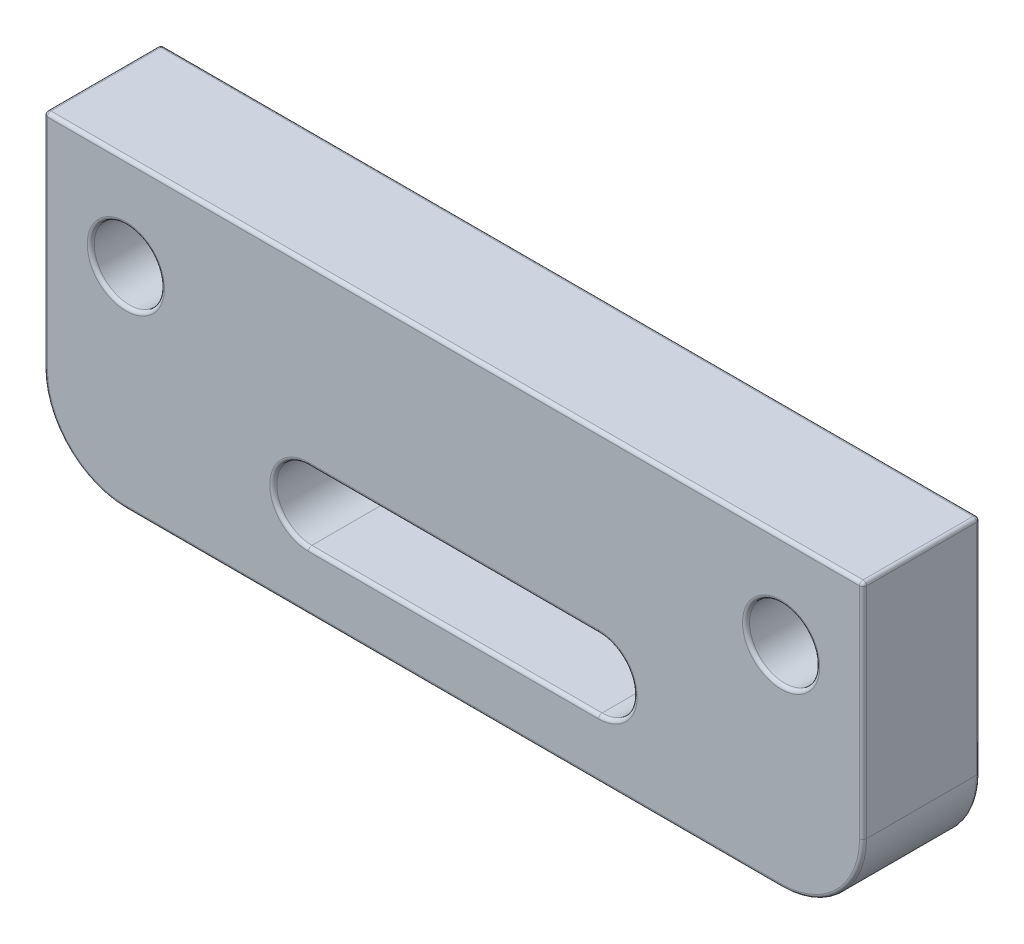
ISO-10303-21;
HEADER;
FILE_DESCRIPTION(('STEP AP214'),'2;1');
FILE_NAME('part.step','',(''),(''),'','','');
FILE_SCHEMA(('AUTOMOTIVE_DESIGN { 1 0 10303 214 1 1 1 1 }'));
ENDSEC;
DATA;
#1=APPLICATION_CONTEXT('core data for automotive mechanical design processes');
#2=APPLICATION_PROTOCOL_DEFINITION('international standard','automotive_design',2000,#1);
#3=PRODUCT_CONTEXT('',#1,'mechanical');
#4=PRODUCT('Part','Part','',(#3));
#5=PRODUCT_RELATED_PRODUCT_CATEGORY('part','',(#4));
#6=PRODUCT_DEFINITION_FORMATION('','',#4);
#7=PRODUCT_DEFINITION_CONTEXT('part definition',#1,'design');
#8=PRODUCT_DEFINITION('design','',#6,#7);
#9=PRODUCT_DEFINITION_SHAPE('','',#8);
#10=(LENGTH_UNIT() NAMED_UNIT(*) SI_UNIT(.MILLI.,.METRE.));
#11=(NAMED_UNIT(*) PLANE_ANGLE_UNIT() SI_UNIT($,.RADIAN.));
#12=(NAMED_UNIT(*) SI_UNIT($,.STERADIAN.) SOLID_ANGLE_UNIT());
#13=UNCERTAINTY_MEASURE_WITH_UNIT(LENGTH_MEASURE(1.E-05),#10,'distance_accuracy_value','');
#14=(GEOMETRIC_REPRESENTATION_CONTEXT(3) GLOBAL_UNCERTAINTY_ASSIGNED_CONTEXT((#13)) GLOBAL_UNIT_ASSIGNED_CONTEXT((#10,
#11,#12)) REPRESENTATION_CONTEXT('',''));
#15=CARTESIAN_POINT('',(0.,0.,0.));
#16=DIRECTION('',(0.,0.,1.));
#17=DIRECTION('',(1.,0.,0.));
#18=AXIS2_PLACEMENT_3D('',#15,#16,#17);
#19=CARTESIAN_POINT('',(0.,8.49264705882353,5.));
#20=DIRECTION('',(0.,0.,-1.));
#21=DIRECTION('',(-1.,0.,0.));
#22=AXIS2_PLACEMENT_3D('',#19,#20,#21);
#23=PLANE('',#22);
#24=CARTESIAN_POINT('',(14.,-15.5,5.));
#25=DIRECTION('',(0.,0.,-1.));
#26=DIRECTION('',(-1.,0.,0.));
#27=AXIS2_PLACEMENT_3D('',#24,#25,#26);
#28=CIRCLE('',#27,3.35);
#29=CARTESIAN_POINT('',(14.,-18.85,5.));
#30=VERTEX_POINT('',#29);
#31=CARTESIAN_POINT('',(17.35,-15.5,5.));
#32=VERTEX_POINT('',#31);
#33=EDGE_CURVE('E42',#30,#32,#28,.F.);
#34=ORIENTED_EDGE('',*,*,#33,.T.);
#35=DIRECTION('',(0.,1.,0.));
#36=VECTOR('',#35,1.);
#37=CARTESIAN_POINT('',(17.35,8.49264705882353,5.));
#38=LINE('',#37,#36);
#39=CARTESIAN_POINT('',(17.35,-6.15,5.));
#40=VERTEX_POINT('',#39);
#41=EDGE_CURVE('E11',#32,#40,#38,.T.);
#42=ORIENTED_EDGE('',*,*,#41,.T.);
#43=DIRECTION('',(1.,0.,0.));
#44=VECTOR('',#43,1.);
#45=CARTESIAN_POINT('',(-17.5,-6.15,5.));
#46=LINE('',#45,#44);
#47=CARTESIAN_POINT('',(-17.35,-6.15,5.));
#48=VERTEX_POINT('',#47);
#49=EDGE_CURVE('E324',#40,#48,#46,.F.);
#50=ORIENTED_EDGE('',*,*,#49,.T.);
#51=DIRECTION('',(0.,-1.,0.));
#52=VECTOR('',#51,1.);
#53=CARTESIAN_POINT('',(-17.35,8.49264705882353,5.));
#54=LINE('',#53,#52);
#55=CARTESIAN_POINT('',(-17.35,-15.5,5.));
#56=VERTEX_POINT('',#55);
#57=EDGE_CURVE('E326',#48,#56,#54,.T.);
#58=ORIENTED_EDGE('',*,*,#57,.T.);
#59=CARTESIAN_POINT('',(-14.,-15.5,5.));
#60=DIRECTION('',(0.,0.,-1.));
#61=DIRECTION('',(-1.,0.,0.));
#62=AXIS2_PLACEMENT_3D('',#59,#60,#61);
#63=CIRCLE('',#62,3.35);
#64=CARTESIAN_POINT('',(-14.,-18.85,5.));
#65=VERTEX_POINT('',#64);
#66=EDGE_CURVE('E328',#56,#65,#63,.F.);
#67=ORIENTED_EDGE('',*,*,#66,.T.);
#68=DIRECTION('',(1.,0.,0.));
#69=VECTOR('',#68,1.);
#70=CARTESIAN_POINT('',(0.,-18.85,5.));
#71=LINE('',#70,#69);
#72=EDGE_CURVE('E53',#65,#30,#71,.T.);
#73=ORIENTED_EDGE('',*,*,#72,.T.);
#74=EDGE_LOOP('',(#34,#42,#50,#58,#67,#73));
#75=FACE_BOUND('',#74,.T.);
#76=CARTESIAN_POINT('',(-14.,-10.,5.));
#77=DIRECTION('',(0.,0.,-1.));
#78=DIRECTION('',(-1.,0.,0.));
#79=AXIS2_PLACEMENT_3D('',#76,#77,#78);
#80=CIRCLE('',#79,1.65);
#81=CARTESIAN_POINT('',(-15.65,-10.,5.));
#82=VERTEX_POINT('',#81);
#83=EDGE_CURVE('E321',#82,#82,#80,.T.);
#84=ORIENTED_EDGE('',*,*,#83,.T.);
#85=EDGE_LOOP('',(#84));
#86=FACE_BOUND('',#85,.T.);
#87=CARTESIAN_POINT('',(6.2,-15.,5.));
#88=DIRECTION('',(0.,0.,-1.));
#89=DIRECTION('',(-1.,0.,0.));
#90=AXIS2_PLACEMENT_3D('',#87,#88,#89);
#91=CIRCLE('',#90,1.65);
#92=CARTESIAN_POINT('',(6.2,-13.35,5.));
#93=VERTEX_POINT('',#92);
#94=CARTESIAN_POINT('',(6.2,-16.65,5.));
#95=VERTEX_POINT('',#94);
#96=EDGE_CURVE('E316',#93,#95,#91,.T.);
#97=ORIENTED_EDGE('',*,*,#96,.T.);
#98=DIRECTION('',(1.,0.,0.));
#99=VECTOR('',#98,1.);
#100=CARTESIAN_POINT('',(-6.2,-16.65,5.));
#101=LINE('',#100,#99);
#102=CARTESIAN_POINT('',(-6.2,-16.65,5.));
#103=VERTEX_POINT('',#102);
#104=EDGE_CURVE('E318',#95,#103,#101,.F.);
#105=ORIENTED_EDGE('',*,*,#104,.T.);
#106=CARTESIAN_POINT('',(-6.2,-15.,5.));
#107=DIRECTION('',(0.,0.,-1.));
#108=DIRECTION('',(-1.,0.,0.));
#109=AXIS2_PLACEMENT_3D('',#106,#107,#108);
#110=CIRCLE('',#109,1.65);
#111=CARTESIAN_POINT('',(-6.2,-13.35,5.));
#112=VERTEX_POINT('',#111);
#113=EDGE_CURVE('E312',#103,#112,#110,.T.);
#114=ORIENTED_EDGE('',*,*,#113,.T.);
#115=DIRECTION('',(-1.,0.,0.));
#116=VECTOR('',#115,1.);
#117=CARTESIAN_POINT('',(6.2,-13.35,5.));
#118=LINE('',#117,#116);
#119=EDGE_CURVE('E314',#112,#93,#118,.F.);
#120=ORIENTED_EDGE('',*,*,#119,.T.);
#121=EDGE_LOOP('',(#97,#105,#114,#120));
#122=FACE_BOUND('',#121,.T.);
#123=CARTESIAN_POINT('',(14.,-10.,5.));
#124=DIRECTION('',(0.,0.,-1.));
#125=DIRECTION('',(-1.,0.,0.));
#126=AXIS2_PLACEMENT_3D('',#123,#124,#125);
#127=CIRCLE('',#126,1.65);
#128=CARTESIAN_POINT('',(12.35,-10.,5.));
#129=VERTEX_POINT('',#128);
#130=EDGE_CURVE('E309',#129,#129,#127,.T.);
#131=ORIENTED_EDGE('',*,*,#130,.T.);
#132=EDGE_LOOP('',(#131));
#133=FACE_BOUND('',#132,.T.);
#134=ADVANCED_FACE('F33',(#75,#86,#122,#133),#23,.F.);
#135=CARTESIAN_POINT('',(0.,8.49264705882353,0.));
#136=DIRECTION('',(0.,0.,-1.));
#137=DIRECTION('',(-1.,0.,0.));
#138=AXIS2_PLACEMENT_3D('',#135,#136,#137);
#139=PLANE('',#138);
#140=DIRECTION('',(1.,0.,0.));
#141=VECTOR('',#140,1.);
#142=CARTESIAN_POINT('',(-14.,-18.85,0.));
#143=LINE('',#142,#141);
#144=CARTESIAN_POINT('',(14.,-18.85,0.));
#145=VERTEX_POINT('',#144);
#146=CARTESIAN_POINT('',(-14.,-18.85,0.));
#147=VERTEX_POINT('',#146);
#148=EDGE_CURVE('E262',#145,#147,#143,.F.);
#149=ORIENTED_EDGE('',*,*,#148,.T.);
#150=CARTESIAN_POINT('',(-14.,-15.5,0.));
#151=DIRECTION('',(0.,0.,-1.));
#152=DIRECTION('',(-1.,0.,0.));
#153=AXIS2_PLACEMENT_3D('',#150,#151,#152);
#154=CIRCLE('',#153,3.35);
#155=CARTESIAN_POINT('',(-17.35,-15.5,0.));
#156=VERTEX_POINT('',#155);
#157=EDGE_CURVE('E264',#147,#156,#154,.T.);
#158=ORIENTED_EDGE('',*,*,#157,.T.);
#159=DIRECTION('',(0.,-1.,0.));
#160=VECTOR('',#159,1.);
#161=CARTESIAN_POINT('',(-17.35,-6.,0.));
#162=LINE('',#161,#160);
#163=CARTESIAN_POINT('',(-17.35,-6.15,0.));
#164=VERTEX_POINT('',#163);
#165=EDGE_CURVE('E254',#156,#164,#162,.F.);
#166=ORIENTED_EDGE('',*,*,#165,.T.);
#167=DIRECTION('',(1.,0.,0.));
#168=VECTOR('',#167,1.);
#169=CARTESIAN_POINT('',(0.,-6.15,0.));
#170=LINE('',#169,#168);
#171=CARTESIAN_POINT('',(17.35,-6.15,0.));
#172=VERTEX_POINT('',#171);
#173=EDGE_CURVE('E256',#164,#172,#170,.T.);
#174=ORIENTED_EDGE('',*,*,#173,.T.);
#175=DIRECTION('',(0.,1.,0.));
#176=VECTOR('',#175,1.);
#177=CARTESIAN_POINT('',(17.35,-15.5,0.));
#178=LINE('',#177,#176);
#179=CARTESIAN_POINT('',(17.35,-15.5,0.));
#180=VERTEX_POINT('',#179);
#181=EDGE_CURVE('E258',#172,#180,#178,.F.);
#182=ORIENTED_EDGE('',*,*,#181,.T.);
#183=CARTESIAN_POINT('',(14.,-15.5,0.));
#184=DIRECTION('',(0.,0.,-1.));
#185=DIRECTION('',(-1.,0.,0.));
#186=AXIS2_PLACEMENT_3D('',#183,#184,#185);
#187=CIRCLE('',#186,3.35);
#188=EDGE_CURVE('E260',#180,#145,#187,.T.);
#189=ORIENTED_EDGE('',*,*,#188,.T.);
#190=EDGE_LOOP('',(#149,#158,#166,#174,#182,#189));
#191=FACE_BOUND('',#190,.T.);
#192=CARTESIAN_POINT('',(-14.,-10.,0.));
#193=DIRECTION('',(0.,0.,-1.));
#194=DIRECTION('',(-1.,0.,0.));
#195=AXIS2_PLACEMENT_3D('',#192,#193,#194);
#196=CIRCLE('',#195,1.65);
#197=CARTESIAN_POINT('',(-15.65,-10.,0.));
#198=VERTEX_POINT('',#197);
#199=EDGE_CURVE('E251',#198,#198,#196,.F.);
#200=ORIENTED_EDGE('',*,*,#199,.T.);
#201=EDGE_LOOP('',(#200));
#202=FACE_BOUND('',#201,.T.);
#203=DIRECTION('',(1.,0.,0.));
#204=VECTOR('',#203,1.);
#205=CARTESIAN_POINT('',(0.,-16.65,0.));
#206=LINE('',#205,#204);
#207=CARTESIAN_POINT('',(-6.2,-16.65,0.));
#208=VERTEX_POINT('',#207);
#209=CARTESIAN_POINT('',(6.2,-16.65,0.));
#210=VERTEX_POINT('',#209);
#211=EDGE_CURVE('E246',#208,#210,#206,.T.);
#212=ORIENTED_EDGE('',*,*,#211,.T.);
#213=CARTESIAN_POINT('',(6.2,-15.,0.));
#214=DIRECTION('',(0.,0.,-1.));
#215=DIRECTION('',(-1.,0.,0.));
#216=AXIS2_PLACEMENT_3D('',#213,#214,#215);
#217=CIRCLE('',#216,1.65);
#218=CARTESIAN_POINT('',(6.2,-13.35,0.));
#219=VERTEX_POINT('',#218);
#220=EDGE_CURVE('E248',#210,#219,#217,.F.);
#221=ORIENTED_EDGE('',*,*,#220,.T.);
#222=DIRECTION('',(-1.,0.,0.));
#223=VECTOR('',#222,1.);
#224=CARTESIAN_POINT('',(0.,-13.35,0.));
#225=LINE('',#224,#223);
#226=CARTESIAN_POINT('',(-6.2,-13.35,0.));
#227=VERTEX_POINT('',#226);
#228=EDGE_CURVE('E242',#219,#227,#225,.T.);
#229=ORIENTED_EDGE('',*,*,#228,.T.);
#230=CARTESIAN_POINT('',(-6.2,-15.,0.));
#231=DIRECTION('',(0.,0.,-1.));
#232=DIRECTION('',(-1.,0.,0.));
#233=AXIS2_PLACEMENT_3D('',#230,#231,#232);
#234=CIRCLE('',#233,1.65);
#235=EDGE_CURVE('E244',#227,#208,#234,.F.);
#236=ORIENTED_EDGE('',*,*,#235,.T.);
#237=EDGE_LOOP('',(#212,#221,#229,#236));
#238=FACE_BOUND('',#237,.T.);
#239=CARTESIAN_POINT('',(14.,-10.,0.));
#240=DIRECTION('',(0.,0.,-1.));
#241=DIRECTION('',(-1.,0.,0.));
#242=AXIS2_PLACEMENT_3D('',#239,#240,#241);
#243=CIRCLE('',#242,1.65);
#244=CARTESIAN_POINT('',(12.35,-10.,0.));
#245=VERTEX_POINT('',#244);
#246=EDGE_CURVE('E239',#245,#245,#243,.F.);
#247=ORIENTED_EDGE('',*,*,#246,.T.);
#248=EDGE_LOOP('',(#247));
#249=FACE_BOUND('',#248,.T.);
#250=ADVANCED_FACE('F489',(#191,#202,#238,#249),#139,.T.);
#251=CARTESIAN_POINT('',(-17.5,9.,5.));
#252=DIRECTION('',(1.,0.,0.));
#253=DIRECTION('',(0.,0.,-1.));
#254=AXIS2_PLACEMENT_3D('',#251,#252,#253);
#255=PLANE('',#254);
#256=DIRECTION('',(0.,0.,1.));
#257=VECTOR('',#256,1.);
#258=CARTESIAN_POINT('',(-17.5,-6.15,0.));
#259=LINE('',#258,#257);
#260=CARTESIAN_POINT('',(-17.5,-6.15,4.85));
#261=VERTEX_POINT('',#260);
#262=CARTESIAN_POINT('',(-17.5,-6.15,0.15));
#263=VERTEX_POINT('',#262);
#264=EDGE_CURVE('E200',#261,#263,#259,.F.);
#265=ORIENTED_EDGE('',*,*,#264,.T.);
#266=DIRECTION('',(0.,-1.,0.));
#267=VECTOR('',#266,1.);
#268=CARTESIAN_POINT('',(-17.5,-15.5,0.15));
#269=LINE('',#268,#267);
#270=CARTESIAN_POINT('',(-17.5,-15.5,0.15));
#271=VERTEX_POINT('',#270);
#272=EDGE_CURVE('E237',#263,#271,#269,.T.);
#273=ORIENTED_EDGE('',*,*,#272,.T.);
#274=DIRECTION('',(0.,0.,-1.));
#275=VECTOR('',#274,1.);
#276=CARTESIAN_POINT('',(-17.5,-15.5,5.));
#277=LINE('',#276,#275);
#278=CARTESIAN_POINT('',(-17.5,-15.5,4.85));
#279=VERTEX_POINT('',#278);
#280=EDGE_CURVE('E218',#271,#279,#277,.F.);
#281=ORIENTED_EDGE('',*,*,#280,.T.);
#282=DIRECTION('',(0.,-1.,0.));
#283=VECTOR('',#282,1.);
#284=CARTESIAN_POINT('',(-17.5,9.,4.85));
#285=LINE('',#284,#283);
#286=EDGE_CURVE('E234',#279,#261,#285,.F.);
#287=ORIENTED_EDGE('',*,*,#286,.T.);
#288=EDGE_LOOP('',(#265,#273,#281,#287));
#289=FACE_BOUND('',#288,.T.);
#290=ADVANCED_FACE('F474',(#289),#255,.F.);
#291=CARTESIAN_POINT('',(17.5,9.,5.));
#292=DIRECTION('',(-1.,0.,0.));
#293=DIRECTION('',(0.,0.,1.));
#294=AXIS2_PLACEMENT_3D('',#291,#292,#293);
#295=PLANE('',#294);
#296=DIRECTION('',(0.,0.,-1.));
#297=VECTOR('',#296,1.);
#298=CARTESIAN_POINT('',(17.5,-15.5,5.));
#299=LINE('',#298,#297);
#300=CARTESIAN_POINT('',(17.5,-15.5,4.85));
#301=VERTEX_POINT('',#300);
#302=CARTESIAN_POINT('',(17.5,-15.5,0.15));
#303=VERTEX_POINT('',#302);
#304=EDGE_CURVE('E430',#301,#303,#299,.T.);
#305=ORIENTED_EDGE('',*,*,#304,.T.);
#306=DIRECTION('',(0.,1.,0.));
#307=VECTOR('',#306,1.);
#308=CARTESIAN_POINT('',(17.5,-6.,0.15));
#309=LINE('',#308,#307);
#310=CARTESIAN_POINT('',(17.5,-6.15,0.15));
#311=VERTEX_POINT('',#310);
#312=EDGE_CURVE('E232',#303,#311,#309,.T.);
#313=ORIENTED_EDGE('',*,*,#312,.T.);
#314=DIRECTION('',(0.,0.,-1.));
#315=VECTOR('',#314,1.);
#316=CARTESIAN_POINT('',(17.5,-6.15,5.));
#317=LINE('',#316,#315);
#318=CARTESIAN_POINT('',(17.5,-6.15,4.85));
#319=VERTEX_POINT('',#318);
#320=EDGE_CURVE('E229',#311,#319,#317,.F.);
#321=ORIENTED_EDGE('',*,*,#320,.T.);
#322=DIRECTION('',(0.,1.,0.));
#323=VECTOR('',#322,1.);
#324=CARTESIAN_POINT('',(17.5,9.,4.85));
#325=LINE('',#324,#323);
#326=EDGE_CURVE('E227',#319,#301,#325,.F.);
#327=ORIENTED_EDGE('',*,*,#326,.T.);
#328=EDGE_LOOP('',(#305,#313,#321,#327));
#329=FACE_BOUND('',#328,.T.);
#330=ADVANCED_FACE('F525',(#329),#295,.F.);
#331=CARTESIAN_POINT('',(-17.5,-19.,5.));
#332=DIRECTION('',(0.,1.,0.));
#333=DIRECTION('',(0.,0.,1.));
#334=AXIS2_PLACEMENT_3D('',#331,#332,#333);
#335=PLANE('',#334);
#336=DIRECTION('',(0.,0.,-1.));
#337=VECTOR('',#336,1.);
#338=CARTESIAN_POINT('',(-14.,-19.,5.));
#339=LINE('',#338,#337);
#340=CARTESIAN_POINT('',(-14.,-19.,4.85));
#341=VERTEX_POINT('',#340);
#342=CARTESIAN_POINT('',(-14.,-19.,0.15));
#343=VERTEX_POINT('',#342);
#344=EDGE_CURVE('E437',#341,#343,#339,.T.);
#345=ORIENTED_EDGE('',*,*,#344,.T.);
#346=DIRECTION('',(1.,0.,0.));
#347=VECTOR('',#346,1.);
#348=CARTESIAN_POINT('',(14.,-19.,0.15));
#349=LINE('',#348,#347);
#350=CARTESIAN_POINT('',(14.,-19.,0.15));
#351=VERTEX_POINT('',#350);
#352=EDGE_CURVE('E273',#343,#351,#349,.T.);
#353=ORIENTED_EDGE('',*,*,#352,.T.);
#354=DIRECTION('',(0.,0.,-1.));
#355=VECTOR('',#354,1.);
#356=CARTESIAN_POINT('',(14.,-19.,5.));
#357=LINE('',#356,#355);
#358=CARTESIAN_POINT('',(14.,-19.,4.85));
#359=VERTEX_POINT('',#358);
#360=EDGE_CURVE('E221',#351,#359,#357,.F.);
#361=ORIENTED_EDGE('',*,*,#360,.T.);
#362=DIRECTION('',(1.,0.,0.));
#363=VECTOR('',#362,1.);
#364=CARTESIAN_POINT('',(-17.5,-19.,4.85));
#365=LINE('',#364,#363);
#366=EDGE_CURVE('E271',#359,#341,#365,.F.);
#367=ORIENTED_EDGE('',*,*,#366,.T.);
#368=EDGE_LOOP('',(#345,#353,#361,#367));
#369=FACE_BOUND('',#368,.T.);
#370=ADVANCED_FACE('F443',(#369),#335,.F.);
#371=CARTESIAN_POINT('',(11.5,-6.,5.));
#372=DIRECTION('',(0.,1.,0.));
#373=DIRECTION('',(-1.,0.,0.));
#374=AXIS2_PLACEMENT_3D('',#371,#372,#373);
#375=PLANE('',#374);
#376=DIRECTION('',(0.,0.,-1.));
#377=VECTOR('',#376,1.);
#378=CARTESIAN_POINT('',(17.35,-6.,0.));
#379=LINE('',#378,#377);
#380=CARTESIAN_POINT('',(17.35,-6.,4.85));
#381=VERTEX_POINT('',#380);
#382=CARTESIAN_POINT('',(17.35,-6.,0.15));
#383=VERTEX_POINT('',#382);
#384=EDGE_CURVE('E193',#381,#383,#379,.T.);
#385=ORIENTED_EDGE('',*,*,#384,.T.);
#386=DIRECTION('',(1.,0.,0.));
#387=VECTOR('',#386,1.);
#388=CARTESIAN_POINT('',(11.5,-6.,0.15));
#389=LINE('',#388,#387);
#390=CARTESIAN_POINT('',(-17.35,-6.,0.15));
#391=VERTEX_POINT('',#390);
#392=EDGE_CURVE('E189',#383,#391,#389,.F.);
#393=ORIENTED_EDGE('',*,*,#392,.T.);
#394=DIRECTION('',(0.,0.,1.));
#395=VECTOR('',#394,1.);
#396=CARTESIAN_POINT('',(-17.35,-6.,5.));
#397=LINE('',#396,#395);
#398=CARTESIAN_POINT('',(-17.35,-6.,4.85));
#399=VERTEX_POINT('',#398);
#400=EDGE_CURVE('E181',#391,#399,#397,.T.);
#401=ORIENTED_EDGE('',*,*,#400,.T.);
#402=DIRECTION('',(1.,0.,0.));
#403=VECTOR('',#402,1.);
#404=CARTESIAN_POINT('',(17.5,-6.,4.85));
#405=LINE('',#404,#403);
#406=EDGE_CURVE('E186',#399,#381,#405,.T.);
#407=ORIENTED_EDGE('',*,*,#406,.T.);
#408=EDGE_LOOP('',(#385,#393,#401,#407));
#409=FACE_BOUND('',#408,.T.);
#410=ADVANCED_FACE('F184',(#409),#375,.T.);
#411=CARTESIAN_POINT('',(-14.,-10.,5.));
#412=DIRECTION('',(0.,0.,-1.));
#413=DIRECTION('',(-1.,0.,0.));
#414=AXIS2_PLACEMENT_3D('',#411,#412,#413);
#415=CYLINDRICAL_SURFACE('',#414,1.5);
#416=CARTESIAN_POINT('',(-14.,-10.,0.15));
#417=DIRECTION('',(0.,0.,-1.));
#418=DIRECTION('',(-1.,0.,0.));
#419=AXIS2_PLACEMENT_3D('',#416,#417,#418);
#420=CIRCLE('',#419,1.5);
#421=CARTESIAN_POINT('',(-15.5,-10.,0.15));
#422=VERTEX_POINT('',#421);
#423=EDGE_CURVE('E282',#422,#422,#420,.T.);
#424=ORIENTED_EDGE('',*,*,#423,.T.);
#425=EDGE_LOOP('',(#424));
#426=FACE_BOUND('',#425,.T.);
#427=CARTESIAN_POINT('',(-14.,-10.,4.85));
#428=DIRECTION('',(0.,0.,-1.));
#429=DIRECTION('',(-1.,0.,0.));
#430=AXIS2_PLACEMENT_3D('',#427,#428,#429);
#431=CIRCLE('',#430,1.5);
#432=CARTESIAN_POINT('',(-15.5,-10.,4.85));
#433=VERTEX_POINT('',#432);
#434=EDGE_CURVE('E279',#433,#433,#431,.F.);
#435=ORIENTED_EDGE('',*,*,#434,.T.);
#436=EDGE_LOOP('',(#435));
#437=FACE_BOUND('',#436,.T.);
#438=ADVANCED_FACE('F796',(#426,#437),#415,.F.);
#439=CARTESIAN_POINT('',(-6.2,-15.,5.));
#440=DIRECTION('',(0.,0.,-1.));
#441=DIRECTION('',(-1.,0.,0.));
#442=AXIS2_PLACEMENT_3D('',#439,#440,#441);
#443=CYLINDRICAL_SURFACE('',#442,1.5);
#444=DIRECTION('',(0.,0.,-1.));
#445=VECTOR('',#444,1.);
#446=CARTESIAN_POINT('',(-6.2,-16.5,5.));
#447=LINE('',#446,#445);
#448=CARTESIAN_POINT('',(-6.2,-16.5,4.85));
#449=VERTEX_POINT('',#448);
#450=CARTESIAN_POINT('',(-6.2,-16.5,0.15));
#451=VERTEX_POINT('',#450);
#452=EDGE_CURVE('E425',#449,#451,#447,.T.);
#453=ORIENTED_EDGE('',*,*,#452,.T.);
#454=CARTESIAN_POINT('',(-6.2,-15.,0.15));
#455=DIRECTION('',(0.,0.,-1.));
#456=DIRECTION('',(-1.,0.,0.));
#457=AXIS2_PLACEMENT_3D('',#454,#455,#456);
#458=CIRCLE('',#457,1.5);
#459=CARTESIAN_POINT('',(-6.2,-13.5,0.15));
#460=VERTEX_POINT('',#459);
#461=EDGE_CURVE('E297',#451,#460,#458,.T.);
#462=ORIENTED_EDGE('',*,*,#461,.T.);
#463=DIRECTION('',(0.,0.,-1.));
#464=VECTOR('',#463,1.);
#465=CARTESIAN_POINT('',(-6.2,-13.5,5.));
#466=LINE('',#465,#464);
#467=CARTESIAN_POINT('',(-6.2,-13.5,4.85));
#468=VERTEX_POINT('',#467);
#469=EDGE_CURVE('E377',#468,#460,#466,.T.);
#470=ORIENTED_EDGE('',*,*,#469,.F.);
#471=CARTESIAN_POINT('',(-6.2,-15.,4.85));
#472=DIRECTION('',(0.,0.,-1.));
#473=DIRECTION('',(-1.,0.,0.));
#474=AXIS2_PLACEMENT_3D('',#471,#472,#473);
#475=CIRCLE('',#474,1.5);
#476=EDGE_CURVE('E295',#468,#449,#475,.F.);
#477=ORIENTED_EDGE('',*,*,#476,.T.);
#478=EDGE_LOOP('',(#453,#462,#470,#477));
#479=FACE_BOUND('',#478,.T.);
#480=ADVANCED_FACE('F861',(#479),#443,.F.);
#481=CARTESIAN_POINT('',(-6.2,-16.5,5.));
#482=DIRECTION('',(0.,1.,0.));
#483=DIRECTION('',(0.,0.,1.));
#484=AXIS2_PLACEMENT_3D('',#481,#482,#483);
#485=PLANE('',#484);
#486=DIRECTION('',(0.,0.,-1.));
#487=VECTOR('',#486,1.);
#488=CARTESIAN_POINT('',(6.2,-16.5,5.));
#489=LINE('',#488,#487);
#490=CARTESIAN_POINT('',(6.2,-16.5,4.85));
#491=VERTEX_POINT('',#490);
#492=CARTESIAN_POINT('',(6.2,-16.5,0.15));
#493=VERTEX_POINT('',#492);
#494=EDGE_CURVE('E423',#491,#493,#489,.T.);
#495=ORIENTED_EDGE('',*,*,#494,.T.);
#496=DIRECTION('',(1.,0.,0.));
#497=VECTOR('',#496,1.);
#498=CARTESIAN_POINT('',(-6.2,-16.5,0.15));
#499=LINE('',#498,#497);
#500=EDGE_CURVE('E293',#493,#451,#499,.F.);
#501=ORIENTED_EDGE('',*,*,#500,.T.);
#502=ORIENTED_EDGE('',*,*,#452,.F.);
#503=DIRECTION('',(1.,0.,0.));
#504=VECTOR('',#503,1.);
#505=CARTESIAN_POINT('',(6.2,-16.5,4.85));
#506=LINE('',#505,#504);
#507=EDGE_CURVE('E290',#449,#491,#506,.T.);
#508=ORIENTED_EDGE('',*,*,#507,.T.);
#509=EDGE_LOOP('',(#495,#501,#502,#508));
#510=FACE_BOUND('',#509,.T.);
#511=ADVANCED_FACE('F422',(#510),#485,.T.);
#512=CARTESIAN_POINT('',(6.2,-15.,5.));
#513=DIRECTION('',(0.,0.,-1.));
#514=DIRECTION('',(-1.,0.,0.));
#515=AXIS2_PLACEMENT_3D('',#512,#513,#514);
#516=CYLINDRICAL_SURFACE('',#515,1.5);
#517=DIRECTION('',(0.,0.,-1.));
#518=VECTOR('',#517,1.);
#519=CARTESIAN_POINT('',(6.2,-13.5,5.));
#520=LINE('',#519,#518);
#521=CARTESIAN_POINT('',(6.2,-13.5,4.85));
#522=VERTEX_POINT('',#521);
#523=CARTESIAN_POINT('',(6.2,-13.5,0.15));
#524=VERTEX_POINT('',#523);
#525=EDGE_CURVE('E428',#522,#524,#520,.T.);
#526=ORIENTED_EDGE('',*,*,#525,.T.);
#527=CARTESIAN_POINT('',(6.2,-15.,0.15));
#528=DIRECTION('',(0.,0.,-1.));
#529=DIRECTION('',(-1.,0.,0.));
#530=AXIS2_PLACEMENT_3D('',#527,#528,#529);
#531=CIRCLE('',#530,1.5);
#532=EDGE_CURVE('E287',#524,#493,#531,.T.);
#533=ORIENTED_EDGE('',*,*,#532,.T.);
#534=ORIENTED_EDGE('',*,*,#494,.F.);
#535=CARTESIAN_POINT('',(6.2,-15.,4.85));
#536=DIRECTION('',(0.,0.,-1.));
#537=DIRECTION('',(-1.,0.,0.));
#538=AXIS2_PLACEMENT_3D('',#535,#536,#537);
#539=CIRCLE('',#538,1.5);
#540=EDGE_CURVE('E285',#491,#522,#539,.F.);
#541=ORIENTED_EDGE('',*,*,#540,.T.);
#542=EDGE_LOOP('',(#526,#533,#534,#541));
#543=FACE_BOUND('',#542,.T.);
#544=ADVANCED_FACE('F426',(#543),#516,.F.);
#545=CARTESIAN_POINT('',(-6.2,-13.5,5.));
#546=DIRECTION('',(0.,-1.,0.));
#547=DIRECTION('',(0.,0.,-1.));
#548=AXIS2_PLACEMENT_3D('',#545,#546,#547);
#549=PLANE('',#548);
#550=ORIENTED_EDGE('',*,*,#469,.T.);
#551=DIRECTION('',(-1.,0.,0.));
#552=VECTOR('',#551,1.);
#553=CARTESIAN_POINT('',(-6.2,-13.5,0.15));
#554=LINE('',#553,#552);
#555=EDGE_CURVE('E301',#460,#524,#554,.F.);
#556=ORIENTED_EDGE('',*,*,#555,.T.);
#557=ORIENTED_EDGE('',*,*,#525,.F.);
#558=DIRECTION('',(-1.,0.,0.));
#559=VECTOR('',#558,1.);
#560=CARTESIAN_POINT('',(-6.2,-13.5,4.85));
#561=LINE('',#560,#559);
#562=EDGE_CURVE('E299',#522,#468,#561,.T.);
#563=ORIENTED_EDGE('',*,*,#562,.T.);
#564=EDGE_LOOP('',(#550,#556,#557,#563));
#565=FACE_BOUND('',#564,.T.);
#566=ADVANCED_FACE('F837',(#565),#549,.T.);
#567=CARTESIAN_POINT('',(14.,-10.,5.));
#568=DIRECTION('',(0.,0.,-1.));
#569=DIRECTION('',(-1.,0.,0.));
#570=AXIS2_PLACEMENT_3D('',#567,#568,#569);
#571=CYLINDRICAL_SURFACE('',#570,1.5);
#572=CARTESIAN_POINT('',(14.,-10.,0.15));
#573=DIRECTION('',(0.,0.,-1.));
#574=DIRECTION('',(-1.,0.,0.));
#575=AXIS2_PLACEMENT_3D('',#572,#573,#574);
#576=CIRCLE('',#575,1.5);
#577=CARTESIAN_POINT('',(12.5,-10.,0.15));
#578=VERTEX_POINT('',#577);
#579=EDGE_CURVE('E306',#578,#578,#576,.T.);
#580=ORIENTED_EDGE('',*,*,#579,.T.);
#581=EDGE_LOOP('',(#580));
#582=FACE_BOUND('',#581,.T.);
#583=CARTESIAN_POINT('',(14.,-10.,4.85));
#584=DIRECTION('',(0.,0.,-1.));
#585=DIRECTION('',(-1.,0.,0.));
#586=AXIS2_PLACEMENT_3D('',#583,#584,#585);
#587=CIRCLE('',#586,1.5);
#588=CARTESIAN_POINT('',(12.5,-10.,4.85));
#589=VERTEX_POINT('',#588);
#590=EDGE_CURVE('E303',#589,#589,#587,.F.);
#591=ORIENTED_EDGE('',*,*,#590,.T.);
#592=EDGE_LOOP('',(#591));
#593=FACE_BOUND('',#592,.T.);
#594=ADVANCED_FACE('F536',(#582,#593),#571,.F.);
#595=CARTESIAN_POINT('',(14.,-15.5,5.));
#596=DIRECTION('',(0.,0.,-1.));
#597=DIRECTION('',(-1.,0.,0.));
#598=AXIS2_PLACEMENT_3D('',#595,#596,#597);
#599=CYLINDRICAL_SURFACE('',#598,3.5);
#600=ORIENTED_EDGE('',*,*,#360,.F.);
#601=CARTESIAN_POINT('',(14.,-15.5,0.15));
#602=DIRECTION('',(0.,0.,-1.));
#603=DIRECTION('',(-1.,0.,0.));
#604=AXIS2_PLACEMENT_3D('',#601,#602,#603);
#605=CIRCLE('',#604,3.5);
#606=EDGE_CURVE('E277',#351,#303,#605,.F.);
#607=ORIENTED_EDGE('',*,*,#606,.T.);
#608=ORIENTED_EDGE('',*,*,#304,.F.);
#609=CARTESIAN_POINT('',(14.,-15.5,4.85));
#610=DIRECTION('',(0.,0.,-1.));
#611=DIRECTION('',(-1.,0.,0.));
#612=AXIS2_PLACEMENT_3D('',#609,#610,#611);
#613=CIRCLE('',#612,3.5);
#614=EDGE_CURVE('E275',#301,#359,#613,.T.);
#615=ORIENTED_EDGE('',*,*,#614,.T.);
#616=EDGE_LOOP('',(#600,#607,#608,#615));
#617=FACE_BOUND('',#616,.T.);
#618=ADVANCED_FACE('F533',(#617),#599,.T.);
#619=CARTESIAN_POINT('',(-14.,-15.5,5.));
#620=DIRECTION('',(0.,0.,-1.));
#621=DIRECTION('',(-1.,0.,0.));
#622=AXIS2_PLACEMENT_3D('',#619,#620,#621);
#623=CYLINDRICAL_SURFACE('',#622,3.5);
#624=ORIENTED_EDGE('',*,*,#280,.F.);
#625=CARTESIAN_POINT('',(-14.,-15.5,0.15));
#626=DIRECTION('',(0.,0.,-1.));
#627=DIRECTION('',(-1.,0.,0.));
#628=AXIS2_PLACEMENT_3D('',#625,#626,#627);
#629=CIRCLE('',#628,3.5);
#630=EDGE_CURVE('E269',#271,#343,#629,.F.);
#631=ORIENTED_EDGE('',*,*,#630,.T.);
#632=ORIENTED_EDGE('',*,*,#344,.F.);
#633=CARTESIAN_POINT('',(-14.,-15.5,4.85));
#634=DIRECTION('',(0.,0.,-1.));
#635=DIRECTION('',(-1.,0.,0.));
#636=AXIS2_PLACEMENT_3D('',#633,#634,#635);
#637=CIRCLE('',#636,3.5);
#638=EDGE_CURVE('E267',#341,#279,#637,.T.);
#639=ORIENTED_EDGE('',*,*,#638,.T.);
#640=EDGE_LOOP('',(#624,#631,#632,#639));
#641=FACE_BOUND('',#640,.T.);
#642=ADVANCED_FACE('F471',(#641),#623,.T.);
#643=CARTESIAN_POINT('',(-14.,-15.5,4.85));
#644=DIRECTION('',(0.,0.,-1.));
#645=DIRECTION('',(-1.,0.,0.));
#646=AXIS2_PLACEMENT_3D('',#643,#644,#645);
#647=TOROIDAL_SURFACE('',#646,3.35,0.15);
#648=CARTESIAN_POINT('',(-17.35,-15.5,4.85));
#649=DIRECTION('',(0.,1.,0.));
#650=DIRECTION('',(0.,0.,1.));
#651=AXIS2_PLACEMENT_3D('',#648,#649,#650);
#652=CIRCLE('',#651,0.15);
#653=EDGE_CURVE('E371',#279,#56,#652,.T.);
#654=ORIENTED_EDGE('',*,*,#653,.F.);
#655=ORIENTED_EDGE('',*,*,#638,.F.);
#656=CARTESIAN_POINT('',(-14.,-18.85,4.85));
#657=DIRECTION('',(1.,0.,0.));
#658=DIRECTION('',(0.,0.,-1.));
#659=AXIS2_PLACEMENT_3D('',#656,#657,#658);
#660=CIRCLE('',#659,0.15);
#661=EDGE_CURVE('E374',#65,#341,#660,.T.);
#662=ORIENTED_EDGE('',*,*,#661,.F.);
#663=ORIENTED_EDGE('',*,*,#66,.F.);
#664=EDGE_LOOP('',(#654,#655,#662,#663));
#665=FACE_BOUND('',#664,.T.);
#666=ADVANCED_FACE('F468',(#665),#647,.T.);
#667=CARTESIAN_POINT('',(-14.,-15.5,0.15));
#668=DIRECTION('',(0.,0.,-1.));
#669=DIRECTION('',(-1.,0.,0.));
#670=AXIS2_PLACEMENT_3D('',#667,#668,#669);
#671=TOROIDAL_SURFACE('',#670,3.35,0.15);
#672=CARTESIAN_POINT('',(-14.,-18.85,0.15));
#673=DIRECTION('',(1.,0.,0.));
#674=DIRECTION('',(0.,0.,-1.));
#675=AXIS2_PLACEMENT_3D('',#672,#673,#674);
#676=CIRCLE('',#675,0.15);
#677=EDGE_CURVE('E365',#343,#147,#676,.T.);
#678=ORIENTED_EDGE('',*,*,#677,.F.);
#679=ORIENTED_EDGE('',*,*,#630,.F.);
#680=CARTESIAN_POINT('',(-17.35,-15.5,0.15));
#681=DIRECTION('',(0.,1.,0.));
#682=DIRECTION('',(0.,0.,1.));
#683=AXIS2_PLACEMENT_3D('',#680,#681,#682);
#684=CIRCLE('',#683,0.15);
#685=EDGE_CURVE('E368',#156,#271,#684,.T.);
#686=ORIENTED_EDGE('',*,*,#685,.F.);
#687=ORIENTED_EDGE('',*,*,#157,.F.);
#688=EDGE_LOOP('',(#678,#679,#686,#687));
#689=FACE_BOUND('',#688,.T.);
#690=ADVANCED_FACE('F507',(#689),#671,.T.);
#691=CARTESIAN_POINT('',(0.,-18.85,4.85));
#692=DIRECTION('',(1.,0.,0.));
#693=DIRECTION('',(0.,0.,-1.));
#694=AXIS2_PLACEMENT_3D('',#691,#692,#693);
#695=CYLINDRICAL_SURFACE('',#694,0.15);
#696=ORIENTED_EDGE('',*,*,#661,.T.);
#697=ORIENTED_EDGE('',*,*,#366,.F.);
#698=CARTESIAN_POINT('',(14.,-18.85,4.85));
#699=DIRECTION('',(1.,0.,0.));
#700=DIRECTION('',(0.,0.,-1.));
#701=AXIS2_PLACEMENT_3D('',#698,#699,#700);
#702=CIRCLE('',#701,0.15);
#703=EDGE_CURVE('E362',#30,#359,#702,.T.);
#704=ORIENTED_EDGE('',*,*,#703,.F.);
#705=ORIENTED_EDGE('',*,*,#72,.F.);
#706=EDGE_LOOP('',(#696,#697,#704,#705));
#707=FACE_BOUND('',#706,.T.);
#708=ADVANCED_FACE('F449',(#707),#695,.T.);
#709=CARTESIAN_POINT('',(-17.35,8.49264705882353,4.85));
#710=DIRECTION('',(0.,-1.,0.));
#711=DIRECTION('',(0.,0.,-1.));
#712=AXIS2_PLACEMENT_3D('',#709,#710,#711);
#713=CYLINDRICAL_SURFACE('',#712,0.15);
#714=ORIENTED_EDGE('',*,*,#653,.T.);
#715=ORIENTED_EDGE('',*,*,#57,.F.);
#716=CARTESIAN_POINT('',(-17.35,-6.15,4.85));
#717=DIRECTION('',(0.,1.,0.));
#718=DIRECTION('',(0.,0.,1.));
#719=AXIS2_PLACEMENT_3D('',#716,#717,#718);
#720=CIRCLE('',#719,0.15);
#721=EDGE_CURVE('E204',#261,#48,#720,.T.);
#722=ORIENTED_EDGE('',*,*,#721,.F.);
#723=ORIENTED_EDGE('',*,*,#286,.F.);
#724=EDGE_LOOP('',(#714,#715,#722,#723));
#725=FACE_BOUND('',#724,.T.);
#726=ADVANCED_FACE('F463',(#725),#713,.T.);
#727=CARTESIAN_POINT('',(-17.35,-6.15,5.));
#728=DIRECTION('',(0.,0.,-1.));
#729=DIRECTION('',(-1.,0.,0.));
#730=AXIS2_PLACEMENT_3D('',#727,#728,#729);
#731=CYLINDRICAL_SURFACE('',#730,0.15);
#732=CARTESIAN_POINT('',(-17.35,-6.15,0.15));
#733=DIRECTION('',(0.,0.,-1.));
#734=DIRECTION('',(0.,1.,0.));
#735=AXIS2_PLACEMENT_3D('',#732,#733,#734);
#736=CIRCLE('',#735,0.15);
#737=EDGE_CURVE('E205',#263,#391,#736,.T.);
#738=ORIENTED_EDGE('',*,*,#737,.F.);
#739=ORIENTED_EDGE('',*,*,#264,.F.);
#740=CARTESIAN_POINT('',(-17.35,-6.15,4.85));
#741=DIRECTION('',(0.,0.,1.));
#742=DIRECTION('',(1.,0.,0.));
#743=AXIS2_PLACEMENT_3D('',#740,#741,#742);
#744=CIRCLE('',#743,0.15);
#745=EDGE_CURVE('E197',#399,#261,#744,.T.);
#746=ORIENTED_EDGE('',*,*,#745,.F.);
#747=ORIENTED_EDGE('',*,*,#400,.F.);
#748=EDGE_LOOP('',(#738,#739,#746,#747));
#749=FACE_BOUND('',#748,.T.);
#750=ADVANCED_FACE('F199',(#749),#731,.T.);
#751=CARTESIAN_POINT('',(-17.35,9.,0.15));
#752=DIRECTION('',(0.,1.,0.));
#753=DIRECTION('',(0.,0.,1.));
#754=AXIS2_PLACEMENT_3D('',#751,#752,#753);
#755=CYLINDRICAL_SURFACE('',#754,0.15);
#756=ORIENTED_EDGE('',*,*,#685,.T.);
#757=ORIENTED_EDGE('',*,*,#272,.F.);
#758=CARTESIAN_POINT('',(-17.35,-6.15,0.15));
#759=DIRECTION('',(0.,1.,0.));
#760=DIRECTION('',(-1.,0.,0.));
#761=AXIS2_PLACEMENT_3D('',#758,#759,#760);
#762=CIRCLE('',#761,0.15);
#763=EDGE_CURVE('E357',#164,#263,#762,.T.);
#764=ORIENTED_EDGE('',*,*,#763,.F.);
#765=ORIENTED_EDGE('',*,*,#165,.F.);
#766=EDGE_LOOP('',(#756,#757,#764,#765));
#767=FACE_BOUND('',#766,.T.);
#768=ADVANCED_FACE('F478',(#767),#755,.T.);
#769=CARTESIAN_POINT('',(-17.5,-18.85,0.15));
#770=DIRECTION('',(-1.,0.,0.));
#771=DIRECTION('',(0.,0.,1.));
#772=AXIS2_PLACEMENT_3D('',#769,#770,#771);
#773=CYLINDRICAL_SURFACE('',#772,0.15);
#774=ORIENTED_EDGE('',*,*,#677,.T.);
#775=ORIENTED_EDGE('',*,*,#148,.F.);
#776=CARTESIAN_POINT('',(14.,-18.85,0.15));
#777=DIRECTION('',(1.,0.,0.));
#778=DIRECTION('',(0.,0.,-1.));
#779=AXIS2_PLACEMENT_3D('',#776,#777,#778);
#780=CIRCLE('',#779,0.15);
#781=EDGE_CURVE('E354',#351,#145,#780,.T.);
#782=ORIENTED_EDGE('',*,*,#781,.F.);
#783=ORIENTED_EDGE('',*,*,#352,.F.);
#784=EDGE_LOOP('',(#774,#775,#782,#783));
#785=FACE_BOUND('',#784,.T.);
#786=ADVANCED_FACE('F504',(#785),#773,.T.);
#787=CARTESIAN_POINT('',(14.,-15.5,4.85));
#788=DIRECTION('',(0.,0.,-1.));
#789=DIRECTION('',(-1.,0.,0.));
#790=AXIS2_PLACEMENT_3D('',#787,#788,#789);
#791=TOROIDAL_SURFACE('',#790,3.35,0.15);
#792=ORIENTED_EDGE('',*,*,#703,.T.);
#793=ORIENTED_EDGE('',*,*,#614,.F.);
#794=CARTESIAN_POINT('',(17.35,-15.5,4.85));
#795=DIRECTION('',(0.,1.,0.));
#796=DIRECTION('',(0.,0.,1.));
#797=AXIS2_PLACEMENT_3D('',#794,#795,#796);
#798=CIRCLE('',#797,0.15);
#799=EDGE_CURVE('E212',#32,#301,#798,.T.);
#800=ORIENTED_EDGE('',*,*,#799,.F.);
#801=ORIENTED_EDGE('',*,*,#33,.F.);
#802=EDGE_LOOP('',(#792,#793,#800,#801));
#803=FACE_BOUND('',#802,.T.);
#804=ADVANCED_FACE('F453',(#803),#791,.T.);
#805=CARTESIAN_POINT('',(-17.35,-6.15,4.85));
#806=DIRECTION('',(0.,0.,1.));
#807=DIRECTION('',(1.,0.,0.));
#808=AXIS2_PLACEMENT_3D('',#805,#806,#807);
#809=SPHERICAL_SURFACE('',#808,0.15);
#810=ORIENTED_EDGE('',*,*,#745,.T.);
#811=ORIENTED_EDGE('',*,*,#721,.T.);
#812=CARTESIAN_POINT('',(-17.35,-6.15,4.85));
#813=DIRECTION('',(-1.,0.,0.));
#814=DIRECTION('',(0.,0.,1.));
#815=AXIS2_PLACEMENT_3D('',#812,#813,#814);
#816=CIRCLE('',#815,0.15);
#817=EDGE_CURVE('E208',#399,#48,#816,.F.);
#818=ORIENTED_EDGE('',*,*,#817,.F.);
#819=EDGE_LOOP('',(#810,#811,#818));
#820=FACE_BOUND('',#819,.T.);
#821=ADVANCED_FACE('F209',(#820),#809,.T.);
#822=CARTESIAN_POINT('',(-17.35,-6.15,0.15));
#823=DIRECTION('',(0.,0.,1.));
#824=DIRECTION('',(1.,0.,0.));
#825=AXIS2_PLACEMENT_3D('',#822,#823,#824);
#826=SPHERICAL_SURFACE('',#825,0.15);
#827=ORIENTED_EDGE('',*,*,#763,.T.);
#828=ORIENTED_EDGE('',*,*,#737,.T.);
#829=CARTESIAN_POINT('',(-17.35,-6.15,0.15));
#830=DIRECTION('',(-1.,0.,0.));
#831=DIRECTION('',(0.,0.,1.));
#832=AXIS2_PLACEMENT_3D('',#829,#830,#831);
#833=CIRCLE('',#832,0.15);
#834=EDGE_CURVE('E213',#164,#391,#833,.F.);
#835=ORIENTED_EDGE('',*,*,#834,.F.);
#836=EDGE_LOOP('',(#827,#828,#835));
#837=FACE_BOUND('',#836,.T.);
#838=ADVANCED_FACE('F482',(#837),#826,.T.);
#839=CARTESIAN_POINT('',(14.,-15.5,0.15));
#840=DIRECTION('',(0.,0.,-1.));
#841=DIRECTION('',(-1.,0.,0.));
#842=AXIS2_PLACEMENT_3D('',#839,#840,#841);
#843=TOROIDAL_SURFACE('',#842,3.35,0.15);
#844=ORIENTED_EDGE('',*,*,#781,.T.);
#845=ORIENTED_EDGE('',*,*,#188,.F.);
#846=CARTESIAN_POINT('',(17.35,-15.5,0.15));
#847=DIRECTION('',(0.,1.,0.));
#848=DIRECTION('',(0.,0.,1.));
#849=AXIS2_PLACEMENT_3D('',#846,#847,#848);
#850=CIRCLE('',#849,0.15);
#851=EDGE_CURVE('E347',#303,#180,#850,.T.);
#852=ORIENTED_EDGE('',*,*,#851,.F.);
#853=ORIENTED_EDGE('',*,*,#606,.F.);
#854=EDGE_LOOP('',(#844,#845,#852,#853));
#855=FACE_BOUND('',#854,.T.);
#856=ADVANCED_FACE('F500',(#855),#843,.T.);
#857=CARTESIAN_POINT('',(17.35,8.49264705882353,4.85));
#858=DIRECTION('',(0.,1.,0.));
#859=DIRECTION('',(0.,0.,1.));
#860=AXIS2_PLACEMENT_3D('',#857,#858,#859);
#861=CYLINDRICAL_SURFACE('',#860,0.15);
#862=ORIENTED_EDGE('',*,*,#799,.T.);
#863=ORIENTED_EDGE('',*,*,#326,.F.);
#864=CARTESIAN_POINT('',(17.35,-6.15,4.85));
#865=DIRECTION('',(0.,1.,0.));
#866=DIRECTION('',(0.,0.,1.));
#867=AXIS2_PLACEMENT_3D('',#864,#865,#866);
#868=CIRCLE('',#867,0.15);
#869=EDGE_CURVE('E344',#40,#319,#868,.T.);
#870=ORIENTED_EDGE('',*,*,#869,.F.);
#871=ORIENTED_EDGE('',*,*,#41,.F.);
#872=EDGE_LOOP('',(#862,#863,#870,#871));
#873=FACE_BOUND('',#872,.T.);
#874=ADVANCED_FACE('F458',(#873),#861,.T.);
#875=CARTESIAN_POINT('',(11.5,-6.15,4.85));
#876=DIRECTION('',(-1.,0.,0.));
#877=DIRECTION('',(0.,-1.,0.));
#878=AXIS2_PLACEMENT_3D('',#875,#876,#877);
#879=CYLINDRICAL_SURFACE('',#878,0.15);
#880=ORIENTED_EDGE('',*,*,#817,.T.);
#881=ORIENTED_EDGE('',*,*,#49,.F.);
#882=CARTESIAN_POINT('',(17.35,-6.15,4.85));
#883=DIRECTION('',(1.,0.,0.));
#884=DIRECTION('',(0.,0.,-1.));
#885=AXIS2_PLACEMENT_3D('',#882,#883,#884);
#886=CIRCLE('',#885,0.15);
#887=EDGE_CURVE('E216',#381,#40,#886,.T.);
#888=ORIENTED_EDGE('',*,*,#887,.F.);
#889=ORIENTED_EDGE('',*,*,#406,.F.);
#890=EDGE_LOOP('',(#880,#881,#888,#889));
#891=FACE_BOUND('',#890,.T.);
#892=ADVANCED_FACE('F215',(#891),#879,.T.);
#893=CARTESIAN_POINT('',(0.,-6.15,0.15));
#894=DIRECTION('',(1.,0.,0.));
#895=DIRECTION('',(0.,1.,0.));
#896=AXIS2_PLACEMENT_3D('',#893,#894,#895);
#897=CYLINDRICAL_SURFACE('',#896,0.15);
#898=ORIENTED_EDGE('',*,*,#834,.T.);
#899=ORIENTED_EDGE('',*,*,#392,.F.);
#900=CARTESIAN_POINT('',(17.35,-6.15,0.15));
#901=DIRECTION('',(1.,0.,0.));
#902=DIRECTION('',(0.,0.,-1.));
#903=AXIS2_PLACEMENT_3D('',#900,#901,#902);
#904=CIRCLE('',#903,0.15);
#905=EDGE_CURVE('E340',#172,#383,#904,.T.);
#906=ORIENTED_EDGE('',*,*,#905,.F.);
#907=ORIENTED_EDGE('',*,*,#173,.F.);
#908=EDGE_LOOP('',(#898,#899,#906,#907));
#909=FACE_BOUND('',#908,.T.);
#910=ADVANCED_FACE('F486',(#909),#897,.T.);
#911=CARTESIAN_POINT('',(17.35,9.,0.15));
#912=DIRECTION('',(0.,-1.,0.));
#913=DIRECTION('',(0.,0.,-1.));
#914=AXIS2_PLACEMENT_3D('',#911,#912,#913);
#915=CYLINDRICAL_SURFACE('',#914,0.15);
#916=ORIENTED_EDGE('',*,*,#851,.T.);
#917=ORIENTED_EDGE('',*,*,#181,.F.);
#918=CARTESIAN_POINT('',(17.35,-6.15,0.15));
#919=DIRECTION('',(0.,1.,0.));
#920=DIRECTION('',(0.,0.,1.));
#921=AXIS2_PLACEMENT_3D('',#918,#919,#920);
#922=CIRCLE('',#921,0.15);
#923=EDGE_CURVE('E337',#311,#172,#922,.T.);
#924=ORIENTED_EDGE('',*,*,#923,.F.);
#925=ORIENTED_EDGE('',*,*,#312,.F.);
#926=EDGE_LOOP('',(#916,#917,#924,#925));
#927=FACE_BOUND('',#926,.T.);
#928=ADVANCED_FACE('F494',(#927),#915,.T.);
#929=CARTESIAN_POINT('',(17.35,-6.15,4.85));
#930=DIRECTION('',(0.,0.,1.));
#931=DIRECTION('',(1.,0.,0.));
#932=AXIS2_PLACEMENT_3D('',#929,#930,#931);
#933=SPHERICAL_SURFACE('',#932,0.15);
#934=ORIENTED_EDGE('',*,*,#887,.T.);
#935=ORIENTED_EDGE('',*,*,#869,.T.);
#936=CARTESIAN_POINT('',(17.35,-6.15,4.85));
#937=DIRECTION('',(0.,0.,1.));
#938=DIRECTION('',(1.,0.,0.));
#939=AXIS2_PLACEMENT_3D('',#936,#937,#938);
#940=CIRCLE('',#939,0.15);
#941=EDGE_CURVE('E334',#381,#319,#940,.F.);
#942=ORIENTED_EDGE('',*,*,#941,.F.);
#943=EDGE_LOOP('',(#934,#935,#942));
#944=FACE_BOUND('',#943,.T.);
#945=ADVANCED_FACE('F547',(#944),#933,.T.);
#946=CARTESIAN_POINT('',(17.35,-6.15,0.15));
#947=DIRECTION('',(0.,0.,1.));
#948=DIRECTION('',(1.,0.,0.));
#949=AXIS2_PLACEMENT_3D('',#946,#947,#948);
#950=SPHERICAL_SURFACE('',#949,0.15);
#951=ORIENTED_EDGE('',*,*,#923,.T.);
#952=ORIENTED_EDGE('',*,*,#905,.T.);
#953=CARTESIAN_POINT('',(17.35,-6.15,0.15));
#954=DIRECTION('',(0.,0.,-1.));
#955=DIRECTION('',(-1.,0.,0.));
#956=AXIS2_PLACEMENT_3D('',#953,#954,#955);
#957=CIRCLE('',#956,0.15);
#958=EDGE_CURVE('E332',#311,#383,#957,.F.);
#959=ORIENTED_EDGE('',*,*,#958,.F.);
#960=EDGE_LOOP('',(#951,#952,#959));
#961=FACE_BOUND('',#960,.T.);
#962=ADVANCED_FACE('F543',(#961),#950,.T.);
#963=CARTESIAN_POINT('',(17.35,-6.15,5.));
#964=DIRECTION('',(0.,0.,1.));
#965=DIRECTION('',(1.,0.,0.));
#966=AXIS2_PLACEMENT_3D('',#963,#964,#965);
#967=CYLINDRICAL_SURFACE('',#966,0.15);
#968=ORIENTED_EDGE('',*,*,#941,.T.);
#969=ORIENTED_EDGE('',*,*,#320,.F.);
#970=ORIENTED_EDGE('',*,*,#958,.T.);
#971=ORIENTED_EDGE('',*,*,#384,.F.);
#972=EDGE_LOOP('',(#968,#969,#970,#971));
#973=FACE_BOUND('',#972,.T.);
#974=ADVANCED_FACE('F539',(#973),#967,.T.);
#975=CARTESIAN_POINT('',(-14.,-10.,0.15));
#976=DIRECTION('',(0.,0.,-1.));
#977=DIRECTION('',(-1.,0.,0.));
#978=AXIS2_PLACEMENT_3D('',#975,#976,#977);
#979=TOROIDAL_SURFACE('',#978,1.65,0.15);
#980=ORIENTED_EDGE('',*,*,#423,.F.);
#981=EDGE_LOOP('',(#980));
#982=FACE_BOUND('',#981,.T.);
#983=ORIENTED_EDGE('',*,*,#199,.F.);
#984=EDGE_LOOP('',(#983));
#985=FACE_BOUND('',#984,.T.);
#986=ADVANCED_FACE('F542',(#982,#985),#979,.T.);
#987=CARTESIAN_POINT('',(-6.2,-15.,0.15));
#988=DIRECTION('',(0.,0.,-1.));
#989=DIRECTION('',(-1.,0.,0.));
#990=AXIS2_PLACEMENT_3D('',#987,#988,#989);
#991=TOROIDAL_SURFACE('',#990,1.65,0.15);
#992=CARTESIAN_POINT('',(-6.2,-13.35,0.15));
#993=DIRECTION('',(1.,0.,0.));
#994=DIRECTION('',(0.,0.,-1.));
#995=AXIS2_PLACEMENT_3D('',#992,#993,#994);
#996=CIRCLE('',#995,0.15);
#997=EDGE_CURVE('E382',#460,#227,#996,.T.);
#998=ORIENTED_EDGE('',*,*,#997,.F.);
#999=ORIENTED_EDGE('',*,*,#461,.F.);
#1000=CARTESIAN_POINT('',(-6.2,-16.65,0.15));
#1001=DIRECTION('',(1.,0.,0.));
#1002=DIRECTION('',(0.,0.,-1.));
#1003=AXIS2_PLACEMENT_3D('',#1000,#1001,#1002);
#1004=CIRCLE('',#1003,0.15);
#1005=EDGE_CURVE('E335',#208,#451,#1004,.T.);
#1006=ORIENTED_EDGE('',*,*,#1005,.F.);
#1007=ORIENTED_EDGE('',*,*,#235,.F.);
#1008=EDGE_LOOP('',(#998,#999,#1006,#1007));
#1009=FACE_BOUND('',#1008,.T.);
#1010=ADVANCED_FACE('F641',(#1009),#991,.T.);
#1011=CARTESIAN_POINT('',(0.,-16.65,0.15));
#1012=DIRECTION('',(1.,0.,0.));
#1013=DIRECTION('',(0.,0.,-1.));
#1014=AXIS2_PLACEMENT_3D('',#1011,#1012,#1013);
#1015=CYLINDRICAL_SURFACE('',#1014,0.15);
#1016=ORIENTED_EDGE('',*,*,#1005,.T.);
#1017=ORIENTED_EDGE('',*,*,#500,.F.);
#1018=CARTESIAN_POINT('',(6.2,-16.65,0.15));
#1019=DIRECTION('',(1.,0.,0.));
#1020=DIRECTION('',(0.,0.,-1.));
#1021=AXIS2_PLACEMENT_3D('',#1018,#1019,#1020);
#1022=CIRCLE('',#1021,0.15);
#1023=EDGE_CURVE('E380',#210,#493,#1022,.T.);
#1024=ORIENTED_EDGE('',*,*,#1023,.F.);
#1025=ORIENTED_EDGE('',*,*,#211,.F.);
#1026=EDGE_LOOP('',(#1016,#1017,#1024,#1025));
#1027=FACE_BOUND('',#1026,.T.);
#1028=ADVANCED_FACE('F649',(#1027),#1015,.T.);
#1029=CARTESIAN_POINT('',(0.,-13.35,0.15));
#1030=DIRECTION('',(-1.,0.,0.));
#1031=DIRECTION('',(0.,0.,1.));
#1032=AXIS2_PLACEMENT_3D('',#1029,#1030,#1031);
#1033=CYLINDRICAL_SURFACE('',#1032,0.15);
#1034=ORIENTED_EDGE('',*,*,#997,.T.);
#1035=ORIENTED_EDGE('',*,*,#228,.F.);
#1036=CARTESIAN_POINT('',(6.2,-13.35,0.15));
#1037=DIRECTION('',(1.,0.,0.));
#1038=DIRECTION('',(0.,0.,-1.));
#1039=AXIS2_PLACEMENT_3D('',#1036,#1037,#1038);
#1040=CIRCLE('',#1039,0.15);
#1041=EDGE_CURVE('E378',#524,#219,#1040,.T.);
#1042=ORIENTED_EDGE('',*,*,#1041,.F.);
#1043=ORIENTED_EDGE('',*,*,#555,.F.);
#1044=EDGE_LOOP('',(#1034,#1035,#1042,#1043));
#1045=FACE_BOUND('',#1044,.T.);
#1046=ADVANCED_FACE('F657',(#1045),#1033,.T.);
#1047=CARTESIAN_POINT('',(6.2,-15.,0.15));
#1048=DIRECTION('',(0.,0.,-1.));
#1049=DIRECTION('',(-1.,0.,0.));
#1050=AXIS2_PLACEMENT_3D('',#1047,#1048,#1049);
#1051=TOROIDAL_SURFACE('',#1050,1.65,0.15);
#1052=ORIENTED_EDGE('',*,*,#1023,.T.);
#1053=ORIENTED_EDGE('',*,*,#532,.F.);
#1054=ORIENTED_EDGE('',*,*,#1041,.T.);
#1055=ORIENTED_EDGE('',*,*,#220,.F.);
#1056=EDGE_LOOP('',(#1052,#1053,#1054,#1055));
#1057=FACE_BOUND('',#1056,.T.);
#1058=ADVANCED_FACE('F665',(#1057),#1051,.T.);
#1059=CARTESIAN_POINT('',(14.,-10.,0.15));
#1060=DIRECTION('',(0.,0.,-1.));
#1061=DIRECTION('',(-1.,0.,0.));
#1062=AXIS2_PLACEMENT_3D('',#1059,#1060,#1061);
#1063=TOROIDAL_SURFACE('',#1062,1.65,0.15);
#1064=ORIENTED_EDGE('',*,*,#579,.F.);
#1065=EDGE_LOOP('',(#1064));
#1066=FACE_BOUND('',#1065,.T.);
#1067=ORIENTED_EDGE('',*,*,#246,.F.);
#1068=EDGE_LOOP('',(#1067));
#1069=FACE_BOUND('',#1068,.T.);
#1070=ADVANCED_FACE('F673',(#1066,#1069),#1063,.T.);
#1071=CARTESIAN_POINT('',(-14.,-10.,4.85));
#1072=DIRECTION('',(0.,0.,-1.));
#1073=DIRECTION('',(-1.,0.,0.));
#1074=AXIS2_PLACEMENT_3D('',#1071,#1072,#1073);
#1075=TOROIDAL_SURFACE('',#1074,1.65,0.15);
#1076=ORIENTED_EDGE('',*,*,#83,.F.);
#1077=EDGE_LOOP('',(#1076));
#1078=FACE_BOUND('',#1077,.T.);
#1079=ORIENTED_EDGE('',*,*,#434,.F.);
#1080=EDGE_LOOP('',(#1079));
#1081=FACE_BOUND('',#1080,.T.);
#1082=ADVANCED_FACE('F681',(#1078,#1081),#1075,.T.);
#1083=CARTESIAN_POINT('',(-6.2,-13.35,4.85));
#1084=DIRECTION('',(1.,0.,0.));
#1085=DIRECTION('',(0.,0.,-1.));
#1086=AXIS2_PLACEMENT_3D('',#1083,#1084,#1085);
#1087=CYLINDRICAL_SURFACE('',#1086,0.15);
#1088=CARTESIAN_POINT('',(6.2,-13.35,4.85));
#1089=DIRECTION('',(1.,0.,0.));
#1090=DIRECTION('',(0.,0.,-1.));
#1091=AXIS2_PLACEMENT_3D('',#1088,#1089,#1090);
#1092=CIRCLE('',#1091,0.15);
#1093=EDGE_CURVE('E390',#93,#522,#1092,.T.);
#1094=ORIENTED_EDGE('',*,*,#1093,.F.);
#1095=ORIENTED_EDGE('',*,*,#119,.F.);
#1096=CARTESIAN_POINT('',(-6.2,-13.35,4.85));
#1097=DIRECTION('',(-1.,0.,0.));
#1098=DIRECTION('',(0.,0.,1.));
#1099=AXIS2_PLACEMENT_3D('',#1096,#1097,#1098);
#1100=CIRCLE('',#1099,0.15);
#1101=EDGE_CURVE('E37',#468,#112,#1100,.T.);
#1102=ORIENTED_EDGE('',*,*,#1101,.F.);
#1103=ORIENTED_EDGE('',*,*,#562,.F.);
#1104=EDGE_LOOP('',(#1094,#1095,#1102,#1103));
#1105=FACE_BOUND('',#1104,.T.);
#1106=ADVANCED_FACE('F406',(#1105),#1087,.T.);
#1107=CARTESIAN_POINT('',(-6.2,-15.,4.85));
#1108=DIRECTION('',(0.,0.,-1.));
#1109=DIRECTION('',(-1.,0.,0.));
#1110=AXIS2_PLACEMENT_3D('',#1107,#1108,#1109);
#1111=TOROIDAL_SURFACE('',#1110,1.65,0.15);
#1112=ORIENTED_EDGE('',*,*,#1101,.T.);
#1113=ORIENTED_EDGE('',*,*,#113,.F.);
#1114=CARTESIAN_POINT('',(-6.2,-16.65,4.85));
#1115=DIRECTION('',(1.,0.,0.));
#1116=DIRECTION('',(0.,0.,-1.));
#1117=AXIS2_PLACEMENT_3D('',#1114,#1115,#1116);
#1118=CIRCLE('',#1117,0.15);
#1119=EDGE_CURVE('E389',#449,#103,#1118,.T.);
#1120=ORIENTED_EDGE('',*,*,#1119,.F.);
#1121=ORIENTED_EDGE('',*,*,#476,.F.);
#1122=EDGE_LOOP('',(#1112,#1113,#1120,#1121));
#1123=FACE_BOUND('',#1122,.T.);
#1124=ADVANCED_FACE('F401',(#1123),#1111,.T.);
#1125=CARTESIAN_POINT('',(6.2,-15.,4.85));
#1126=DIRECTION('',(0.,0.,-1.));
#1127=DIRECTION('',(-1.,0.,0.));
#1128=AXIS2_PLACEMENT_3D('',#1125,#1126,#1127);
#1129=TOROIDAL_SURFACE('',#1128,1.65,0.15);
#1130=ORIENTED_EDGE('',*,*,#1093,.T.);
#1131=ORIENTED_EDGE('',*,*,#540,.F.);
#1132=CARTESIAN_POINT('',(6.2,-16.65,4.85));
#1133=DIRECTION('',(-1.,0.,0.));
#1134=DIRECTION('',(0.,0.,1.));
#1135=AXIS2_PLACEMENT_3D('',#1132,#1133,#1134);
#1136=CIRCLE('',#1135,0.15);
#1137=EDGE_CURVE('E387',#95,#491,#1136,.T.);
#1138=ORIENTED_EDGE('',*,*,#1137,.F.);
#1139=ORIENTED_EDGE('',*,*,#96,.F.);
#1140=EDGE_LOOP('',(#1130,#1131,#1138,#1139));
#1141=FACE_BOUND('',#1140,.T.);
#1142=ADVANCED_FACE('F414',(#1141),#1129,.T.);
#1143=CARTESIAN_POINT('',(-6.2,-16.65,4.85));
#1144=DIRECTION('',(-1.,0.,0.));
#1145=DIRECTION('',(0.,0.,1.));
#1146=AXIS2_PLACEMENT_3D('',#1143,#1144,#1145);
#1147=CYLINDRICAL_SURFACE('',#1146,0.15);
#1148=ORIENTED_EDGE('',*,*,#1119,.T.);
#1149=ORIENTED_EDGE('',*,*,#104,.F.);
#1150=ORIENTED_EDGE('',*,*,#1137,.T.);
#1151=ORIENTED_EDGE('',*,*,#507,.F.);
#1152=EDGE_LOOP('',(#1148,#1149,#1150,#1151));
#1153=FACE_BOUND('',#1152,.T.);
#1154=ADVANCED_FACE('F412',(#1153),#1147,.T.);
#1155=CARTESIAN_POINT('',(14.,-10.,4.85));
#1156=DIRECTION('',(0.,0.,-1.));
#1157=DIRECTION('',(-1.,0.,0.));
#1158=AXIS2_PLACEMENT_3D('',#1155,#1156,#1157);
#1159=TOROIDAL_SURFACE('',#1158,1.65,0.15);
#1160=ORIENTED_EDGE('',*,*,#130,.F.);
#1161=EDGE_LOOP('',(#1160));
#1162=FACE_BOUND('',#1161,.T.);
#1163=ORIENTED_EDGE('',*,*,#590,.F.);
#1164=EDGE_LOOP('',(#1163));
#1165=FACE_BOUND('',#1164,.T.);
#1166=ADVANCED_FACE('F35',(#1162,#1165),#1159,.T.);
#1167=CLOSED_SHELL('',(#134,#250,#290,#330,#370,#410,#438,#480,#511,#544,#566,#594,#618,#642,
#666,#690,#708,#726,#750,#768,#786,#804,#821,#838,#856,#874,#892,#910,#928,#945,#962,#974,#986,
#1010,#1028,#1046,#1058,#1070,#1082,#1106,#1124,#1142,#1154,#1166));
#1168=MANIFOLD_SOLID_BREP('B2',#1167);
#1169=ADVANCED_BREP_SHAPE_REPRESENTATION('',(#18,#1168),#14);
#1170=SHAPE_DEFINITION_REPRESENTATION(#9,#1169);
ENDSEC;
END-ISO-10303-21;
